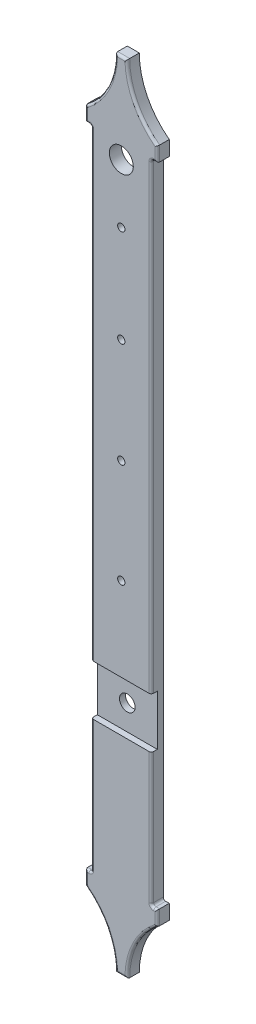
from build123d import *

# Parameters (mm, degrees)
BOSS_EXTRUDE1_DEPTH = 10
FILLET1_R           = 2
SKETCH2_R           = 10
SKETCH2_R_2         = 3.05
CUT_EXTRUDE1_DEPTH  = 55.3
FILLET2_R           = 2
SKETCH3_R           = 6.5
CUT_EXTRUDE2_DEPTH  = 97
SKETCH5_W           = 50
SKETCH5_H           = 42
CUT_EXTRUDE3_DEPTH  = 5


with BuildPart() as part:
    # Sketch1 → Boss-Extrude1 (new body)
    with BuildSketch(Plane.XY):
        with BuildLine():
            Line((30, 269.7), (25, 269.7))
            Line((25, 269.7), (25, -269.7))
            Line((25, -269.7), (30, -269.7))
            Line((30, -269.7), (30, -282))
            ThreePointArc((30, -282), (11.603828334, -304.050594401), (5.01, -332))
            Line((5.01, -332), (-5.01, -332))
            ThreePointArc((-5.01, -332), (-11.603828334, -304.050594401), (-30, -282))
            Line((-30, -282), (-30, -269.7))
            Line((-30, -269.7), (-25, -269.7))
            Line((-25, -269.7), (-25, 269.7))
            Line((-25, 269.7), (-30, 269.7))
            Line((-30, 269.7), (-30, 282))
            ThreePointArc((-30, 282), (-11.603828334, 304.050594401), (-5.01, 332))
            Line((-5.01, 332), (5.01, 332))
            ThreePointArc((5.01, 332), (11.603828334, 304.050594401), (30, 282))
            Line((30, 282), (30, 269.7))
        make_face()
    extrude(amount=BOSS_EXTRUDE1_DEPTH)

    # Fillet1
    fillet1_edges = [part.edges().sort_by_distance(p)[0] for p in [
        (-25, -269.7, 5),
        (-25, 269.7, 5),
        (25, 269.7, 5),
        (25, -269.7, 5),
    ]]
    fillet(fillet1_edges, radius=FILLET1_R)

    # Sketch2 → Cut-Extrude1 (cut)
    with BuildSketch(Plane.XY.offset(10)):
        with Locations((0, 257.4)):
            Circle(SKETCH2_R)
        with Locations((0, 208.4)):
            Circle(SKETCH2_R_2)
        with Locations((0, 127.4)):
            Circle(SKETCH2_R_2)
        with Locations((0, 40)):
            Circle(SKETCH2_R_2)
        with Locations((0, -46.68)):
            Circle(SKETCH2_R_2)
    extrude(amount=-CUT_EXTRUDE1_DEPTH, mode=Mode.SUBTRACT)

    # Fillet2
    fillet2_edges = [part.edges().sort_by_distance(p)[0] for p in [
        (30, 275.85, 10),
        (11.603828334, 304.050594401, 10),
        (0, 332, 10),
        (-11.603828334, 304.050594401, 10),
        (-30, 275.85, 10),
        (-28.5, 269.7, 10),
        (-30, -275.85, 10),
        (28.5, -269.7, 10),
        (-11.603828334, -304.050594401, 10),
        (0, -332, 10),
        (-28.5, -269.7, 10),
        (-25, 0, 10),
        (11.603828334, -304.050594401, 10),
        (25, 0, 10),
        (30, -275.85, 10),
        (28.5, 269.7, 10),
        (-25.585786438, -269.114213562, 10),
        (25.585786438, -269.114213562, 10),
        (25.585786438, 269.114213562, 10),
        (-25.585786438, 269.114213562, 10),
    ]]
    fillet(fillet2_edges, radius=FILLET2_R)

    # Sketch3 → Cut-Extrude2 (cut)
    with BuildSketch(Plane.XY.offset(10)):
        with Locations((0, -137.5)):
            Circle(SKETCH3_R)
    extrude(amount=-CUT_EXTRUDE2_DEPTH, mode=Mode.SUBTRACT)

    # Sketch5 → Cut-Extrude3 (cut)
    with BuildSketch(Plane.XY.offset(10)):
        with Locations((0, -137.5)):
            Rectangle(SKETCH5_W, SKETCH5_H)
    extrude(amount=-CUT_EXTRUDE3_DEPTH, mode=Mode.SUBTRACT)


solid = part.part
